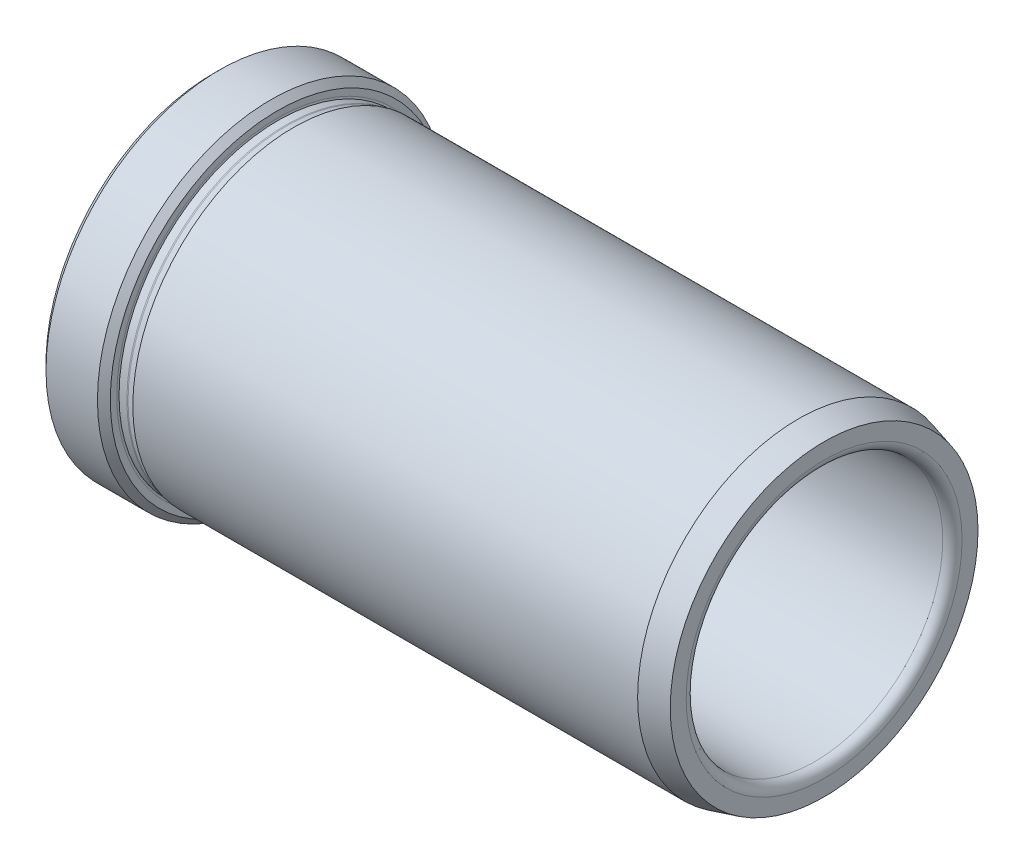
ISO-10303-21;
HEADER;
FILE_DESCRIPTION(('STEP AP214'),'2;1');
FILE_NAME('part.step','',(''),(''),'','','');
FILE_SCHEMA(('AUTOMOTIVE_DESIGN { 1 0 10303 214 1 1 1 1 }'));
ENDSEC;
DATA;
#1=APPLICATION_CONTEXT('core data for automotive mechanical design processes');
#2=APPLICATION_PROTOCOL_DEFINITION('international standard','automotive_design',2000,#1);
#3=PRODUCT_CONTEXT('',#1,'mechanical');
#4=PRODUCT('Part','Part','',(#3));
#5=PRODUCT_RELATED_PRODUCT_CATEGORY('part','',(#4));
#6=PRODUCT_DEFINITION_FORMATION('','',#4);
#7=PRODUCT_DEFINITION_CONTEXT('part definition',#1,'design');
#8=PRODUCT_DEFINITION('design','',#6,#7);
#9=PRODUCT_DEFINITION_SHAPE('','',#8);
#10=(LENGTH_UNIT() NAMED_UNIT(*) SI_UNIT(.MILLI.,.METRE.));
#11=(NAMED_UNIT(*) PLANE_ANGLE_UNIT() SI_UNIT($,.RADIAN.));
#12=(NAMED_UNIT(*) SI_UNIT($,.STERADIAN.) SOLID_ANGLE_UNIT());
#13=UNCERTAINTY_MEASURE_WITH_UNIT(LENGTH_MEASURE(1.E-05),#10,'distance_accuracy_value','');
#14=(GEOMETRIC_REPRESENTATION_CONTEXT(3) GLOBAL_UNCERTAINTY_ASSIGNED_CONTEXT((#13)) GLOBAL_UNIT_ASSIGNED_CONTEXT((#10,
#11,#12)) REPRESENTATION_CONTEXT('',''));
#15=CARTESIAN_POINT('',(0.,0.,0.));
#16=DIRECTION('',(0.,0.,1.));
#17=DIRECTION('',(1.,0.,0.));
#18=AXIS2_PLACEMENT_3D('',#15,#16,#17);
#19=CARTESIAN_POINT('',(30.9097582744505,19.95,0.));
#20=DIRECTION('',(1.,0.,0.));
#21=DIRECTION('',(0.,0.,-1.));
#22=AXIS2_PLACEMENT_3D('',#19,#20,#21);
#23=PLANE('',#22);
#24=CARTESIAN_POINT('',(30.9097582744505,0.,0.));
#25=DIRECTION('',(-1.,0.,0.));
#26=DIRECTION('',(0.,0.,1.));
#27=AXIS2_PLACEMENT_3D('',#24,#25,#26);
#28=CIRCLE('',#27,19.95);
#29=CARTESIAN_POINT('',(30.9097582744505,0.,19.95));
#30=VERTEX_POINT('',#29);
#31=EDGE_CURVE('E46',#30,#30,#28,.T.);
#32=ORIENTED_EDGE('',*,*,#31,.F.);
#33=EDGE_LOOP('',(#32));
#34=FACE_BOUND('',#33,.T.);
#35=CARTESIAN_POINT('',(30.9097582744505,0.,0.));
#36=DIRECTION('',(-1.,0.,0.));
#37=DIRECTION('',(0.,0.,1.));
#38=AXIS2_PLACEMENT_3D('',#35,#36,#37);
#39=CIRCLE('',#38,20.);
#40=CARTESIAN_POINT('',(30.9097582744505,0.,20.));
#41=VERTEX_POINT('',#40);
#42=EDGE_CURVE('E70',#41,#41,#39,.T.);
#43=ORIENTED_EDGE('',*,*,#42,.T.);
#44=EDGE_LOOP('',(#43));
#45=FACE_BOUND('',#44,.T.);
#46=ADVANCED_FACE('F14',(#34,#45),#23,.F.);
#47=CARTESIAN_POINT('',(0.,0.,0.));
#48=DIRECTION('',(-1.,0.,0.));
#49=DIRECTION('',(0.,0.,1.));
#50=AXIS2_PLACEMENT_3D('',#47,#48,#49);
#51=CYLINDRICAL_SURFACE('',#50,19.95);
#52=CARTESIAN_POINT('',(94.4097582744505,0.,0.));
#53=DIRECTION('',(-1.,0.,0.));
#54=DIRECTION('',(0.,0.,1.));
#55=AXIS2_PLACEMENT_3D('',#52,#53,#54);
#56=CIRCLE('',#55,19.95);
#57=CARTESIAN_POINT('',(94.4097582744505,0.,19.95));
#58=VERTEX_POINT('',#57);
#59=EDGE_CURVE('E34',#58,#58,#56,.F.);
#60=ORIENTED_EDGE('',*,*,#59,.T.);
#61=EDGE_LOOP('',(#60));
#62=FACE_BOUND('',#61,.T.);
#63=ORIENTED_EDGE('',*,*,#31,.T.);
#64=EDGE_LOOP('',(#63));
#65=FACE_BOUND('',#64,.T.);
#66=ADVANCED_FACE('F94',(#62,#65),#51,.F.);
#67=CARTESIAN_POINT('',(95.9097582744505,23.9282032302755,0.));
#68=DIRECTION('',(-1.,0.,0.));
#69=DIRECTION('',(0.,0.,1.));
#70=AXIS2_PLACEMENT_3D('',#67,#68,#69);
#71=PLANE('',#70);
#72=CARTESIAN_POINT('',(95.9097582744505,0.,0.));
#73=DIRECTION('',(-1.,0.,0.));
#74=DIRECTION('',(0.,0.,1.));
#75=AXIS2_PLACEMENT_3D('',#72,#73,#74);
#76=CIRCLE('',#75,21.45);
#77=CARTESIAN_POINT('',(95.9097582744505,0.,21.45));
#78=VERTEX_POINT('',#77);
#79=EDGE_CURVE('E37',#78,#78,#76,.T.);
#80=ORIENTED_EDGE('',*,*,#79,.T.);
#81=EDGE_LOOP('',(#80));
#82=FACE_BOUND('',#81,.T.);
#83=CARTESIAN_POINT('',(95.9097582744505,0.,0.));
#84=DIRECTION('',(-1.,0.,0.));
#85=DIRECTION('',(0.,0.,1.));
#86=AXIS2_PLACEMENT_3D('',#83,#84,#85);
#87=CIRCLE('',#86,23.9282032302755);
#88=CARTESIAN_POINT('',(95.9097582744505,0.,23.9282032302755));
#89=VERTEX_POINT('',#88);
#90=EDGE_CURVE('E49',#89,#89,#87,.T.);
#91=ORIENTED_EDGE('',*,*,#90,.F.);
#92=EDGE_LOOP('',(#91));
#93=FACE_BOUND('',#92,.T.);
#94=ADVANCED_FACE('F101',(#82,#93),#71,.F.);
#95=CARTESIAN_POINT('',(95.9097582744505,0.,0.));
#96=DIRECTION('',(-1.,0.,0.));
#97=DIRECTION('',(0.,0.,1.));
#98=AXIS2_PLACEMENT_3D('',#95,#96,#97);
#99=CONICAL_SURFACE('',#98,23.9282032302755,0.26179938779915);
#100=CARTESIAN_POINT('',(91.9097582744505,0.,0.));
#101=DIRECTION('',(-1.,0.,0.));
#102=DIRECTION('',(0.,0.,1.));
#103=AXIS2_PLACEMENT_3D('',#100,#101,#102);
#104=CIRCLE('',#103,25.);
#105=CARTESIAN_POINT('',(91.9097582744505,0.,25.));
#106=VERTEX_POINT('',#105);
#107=EDGE_CURVE('E52',#106,#106,#104,.T.);
#108=ORIENTED_EDGE('',*,*,#107,.F.);
#109=EDGE_LOOP('',(#108));
#110=FACE_BOUND('',#109,.T.);
#111=ORIENTED_EDGE('',*,*,#90,.T.);
#112=EDGE_LOOP('',(#111));
#113=FACE_BOUND('',#112,.T.);
#114=ADVANCED_FACE('F165',(#110,#113),#99,.T.);
#115=CARTESIAN_POINT('',(0.,0.,0.));
#116=DIRECTION('',(-1.,0.,0.));
#117=DIRECTION('',(0.,0.,1.));
#118=AXIS2_PLACEMENT_3D('',#115,#116,#117);
#119=CYLINDRICAL_SURFACE('',#118,25.);
#120=CARTESIAN_POINT('',(13.4097582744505,0.,0.));
#121=DIRECTION('',(-1.,0.,0.));
#122=DIRECTION('',(0.,0.,1.));
#123=AXIS2_PLACEMENT_3D('',#120,#121,#122);
#124=CIRCLE('',#123,25.);
#125=CARTESIAN_POINT('',(13.4097582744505,0.,25.));
#126=VERTEX_POINT('',#125);
#127=EDGE_CURVE('E55',#126,#126,#124,.T.);
#128=ORIENTED_EDGE('',*,*,#127,.F.);
#129=EDGE_LOOP('',(#128));
#130=FACE_BOUND('',#129,.T.);
#131=ORIENTED_EDGE('',*,*,#107,.T.);
#132=EDGE_LOOP('',(#131));
#133=FACE_BOUND('',#132,.T.);
#134=ADVANCED_FACE('F205',(#130,#133),#119,.T.);
#135=CARTESIAN_POINT('',(13.4097582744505,0.,0.));
#136=DIRECTION('',(1.,0.,0.));
#137=DIRECTION('',(0.,0.,-1.));
#138=AXIS2_PLACEMENT_3D('',#135,#136,#137);
#139=CONICAL_SURFACE('',#138,25.,0.261799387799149);
#140=CARTESIAN_POINT('',(12.3918762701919,0.,0.));
#141=DIRECTION('',(-1.,0.,0.));
#142=DIRECTION('',(0.,0.,1.));
#143=AXIS2_PLACEMENT_3D('',#140,#141,#142);
#144=CIRCLE('',#143,24.7272593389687);
#145=CARTESIAN_POINT('',(12.3918762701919,0.,24.7272593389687));
#146=VERTEX_POINT('',#145);
#147=EDGE_CURVE('E58',#146,#146,#144,.T.);
#148=ORIENTED_EDGE('',*,*,#147,.F.);
#149=EDGE_LOOP('',(#148));
#150=FACE_BOUND('',#149,.T.);
#151=ORIENTED_EDGE('',*,*,#127,.T.);
#152=EDGE_LOOP('',(#151));
#153=FACE_BOUND('',#152,.T.);
#154=ADVANCED_FACE('F195',(#150,#153),#139,.T.);
#155=CARTESIAN_POINT('',(12.1848210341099,0.,0.));
#156=DIRECTION('',(-1.,0.,0.));
#157=DIRECTION('',(0.,0.,1.));
#158=AXIS2_PLACEMENT_3D('',#155,#156,#157);
#159=TOROIDAL_SURFACE('',#158,25.5,0.8);
#160=CARTESIAN_POINT('',(12.1848210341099,0.,0.));
#161=DIRECTION('',(-1.,0.,0.));
#162=DIRECTION('',(0.,0.,1.));
#163=AXIS2_PLACEMENT_3D('',#160,#161,#162);
#164=CIRCLE('',#163,24.7);
#165=CARTESIAN_POINT('',(12.1848210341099,0.,24.7));
#166=VERTEX_POINT('',#165);
#167=EDGE_CURVE('E61',#166,#166,#164,.T.);
#168=ORIENTED_EDGE('',*,*,#167,.F.);
#169=EDGE_LOOP('',(#168));
#170=FACE_BOUND('',#169,.T.);
#171=ORIENTED_EDGE('',*,*,#147,.T.);
#172=EDGE_LOOP('',(#171));
#173=FACE_BOUND('',#172,.T.);
#174=ADVANCED_FACE('F185',(#170,#173),#159,.F.);
#175=CARTESIAN_POINT('',(0.,0.,0.));
#176=DIRECTION('',(-1.,0.,0.));
#177=DIRECTION('',(0.,0.,1.));
#178=AXIS2_PLACEMENT_3D('',#175,#176,#177);
#179=CYLINDRICAL_SURFACE('',#178,24.7);
#180=CARTESIAN_POINT('',(10.9669769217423,0.,0.));
#181=DIRECTION('',(-1.,0.,0.));
#182=DIRECTION('',(0.,0.,1.));
#183=AXIS2_PLACEMENT_3D('',#180,#181,#182);
#184=CIRCLE('',#183,24.7);
#185=CARTESIAN_POINT('',(10.9669769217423,0.,24.7));
#186=VERTEX_POINT('',#185);
#187=EDGE_CURVE('E64',#186,#186,#184,.T.);
#188=ORIENTED_EDGE('',*,*,#187,.F.);
#189=EDGE_LOOP('',(#188));
#190=FACE_BOUND('',#189,.T.);
#191=ORIENTED_EDGE('',*,*,#167,.T.);
#192=EDGE_LOOP('',(#191));
#193=FACE_BOUND('',#192,.T.);
#194=ADVANCED_FACE('F175',(#190,#193),#179,.T.);
#195=CARTESIAN_POINT('',(11.7097582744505,0.,0.));
#196=DIRECTION('',(-1.,0.,0.));
#197=DIRECTION('',(0.,0.,1.));
#198=AXIS2_PLACEMENT_3D('',#195,#196,#197);
#199=TOROIDAL_SURFACE('',#198,24.9971125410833,0.8);
#200=CARTESIAN_POINT('',(10.9097582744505,0.,0.));
#201=DIRECTION('',(-1.,0.,0.));
#202=DIRECTION('',(0.,0.,1.));
#203=AXIS2_PLACEMENT_3D('',#200,#201,#202);
#204=CIRCLE('',#203,24.9971125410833);
#205=CARTESIAN_POINT('',(10.9097582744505,0.,24.9971125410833));
#206=VERTEX_POINT('',#205);
#207=EDGE_CURVE('E67',#206,#206,#204,.T.);
#208=ORIENTED_EDGE('',*,*,#207,.F.);
#209=EDGE_LOOP('',(#208));
#210=FACE_BOUND('',#209,.T.);
#211=ORIENTED_EDGE('',*,*,#187,.T.);
#212=EDGE_LOOP('',(#211));
#213=FACE_BOUND('',#212,.T.);
#214=ADVANCED_FACE('F154',(#210,#213),#199,.F.);
#215=CARTESIAN_POINT('',(10.9097582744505,27.,0.));
#216=DIRECTION('',(-1.,0.,0.));
#217=DIRECTION('',(0.,0.,1.));
#218=AXIS2_PLACEMENT_3D('',#215,#216,#217);
#219=PLANE('',#218);
#220=CARTESIAN_POINT('',(10.9097582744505,0.,0.));
#221=DIRECTION('',(-1.,0.,0.));
#222=DIRECTION('',(0.,0.,1.));
#223=AXIS2_PLACEMENT_3D('',#220,#221,#222);
#224=CIRCLE('',#223,26.);
#225=CARTESIAN_POINT('',(10.9097582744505,0.,26.));
#226=VERTEX_POINT('',#225);
#227=EDGE_CURVE('E9',#226,#226,#224,.F.);
#228=ORIENTED_EDGE('',*,*,#227,.T.);
#229=EDGE_LOOP('',(#228));
#230=FACE_BOUND('',#229,.T.);
#231=ORIENTED_EDGE('',*,*,#207,.T.);
#232=EDGE_LOOP('',(#231));
#233=FACE_BOUND('',#232,.T.);
#234=ADVANCED_FACE('F144',(#230,#233),#219,.F.);
#235=CARTESIAN_POINT('',(0.,0.,0.));
#236=DIRECTION('',(-1.,0.,0.));
#237=DIRECTION('',(0.,0.,1.));
#238=AXIS2_PLACEMENT_3D('',#235,#236,#237);
#239=CYLINDRICAL_SURFACE('',#238,27.);
#240=CARTESIAN_POINT('',(9.90975827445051,0.,0.));
#241=DIRECTION('',(-1.,0.,0.));
#242=DIRECTION('',(0.,0.,1.));
#243=AXIS2_PLACEMENT_3D('',#240,#241,#242);
#244=CIRCLE('',#243,27.);
#245=CARTESIAN_POINT('',(9.90975827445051,0.,27.));
#246=VERTEX_POINT('',#245);
#247=EDGE_CURVE('E21',#246,#246,#244,.T.);
#248=ORIENTED_EDGE('',*,*,#247,.T.);
#249=EDGE_LOOP('',(#248));
#250=FACE_BOUND('',#249,.T.);
#251=CARTESIAN_POINT('',(1.9097582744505,0.,0.));
#252=DIRECTION('',(1.,0.,0.));
#253=DIRECTION('',(0.,0.,-1.));
#254=AXIS2_PLACEMENT_3D('',#251,#252,#253);
#255=CIRCLE('',#254,27.);
#256=CARTESIAN_POINT('',(1.9097582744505,0.,-27.));
#257=VERTEX_POINT('',#256);
#258=EDGE_CURVE('E40',#257,#257,#255,.T.);
#259=ORIENTED_EDGE('',*,*,#258,.T.);
#260=EDGE_LOOP('',(#259));
#261=FACE_BOUND('',#260,.T.);
#262=ADVANCED_FACE('F90',(#250,#261),#239,.T.);
#263=CARTESIAN_POINT('',(0.909758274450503,27.,0.));
#264=DIRECTION('',(1.,0.,0.));
#265=DIRECTION('',(0.,0.,-1.));
#266=AXIS2_PLACEMENT_3D('',#263,#264,#265);
#267=PLANE('',#266);
#268=CARTESIAN_POINT('',(0.909758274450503,0.,0.));
#269=DIRECTION('',(1.,0.,0.));
#270=DIRECTION('',(0.,0.,-1.));
#271=AXIS2_PLACEMENT_3D('',#268,#269,#270);
#272=CIRCLE('',#271,21.5);
#273=CARTESIAN_POINT('',(0.909758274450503,0.,-21.5));
#274=VERTEX_POINT('',#273);
#275=EDGE_CURVE('E25',#274,#274,#272,.T.);
#276=ORIENTED_EDGE('',*,*,#275,.T.);
#277=EDGE_LOOP('',(#276));
#278=FACE_BOUND('',#277,.T.);
#279=CARTESIAN_POINT('',(0.909758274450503,0.,0.));
#280=DIRECTION('',(1.,0.,0.));
#281=DIRECTION('',(0.,0.,-1.));
#282=AXIS2_PLACEMENT_3D('',#279,#280,#281);
#283=CIRCLE('',#282,26.);
#284=CARTESIAN_POINT('',(0.909758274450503,0.,-26.));
#285=VERTEX_POINT('',#284);
#286=EDGE_CURVE('E43',#285,#285,#283,.F.);
#287=ORIENTED_EDGE('',*,*,#286,.T.);
#288=EDGE_LOOP('',(#287));
#289=FACE_BOUND('',#288,.T.);
#290=ADVANCED_FACE('F78',(#278,#289),#267,.F.);
#291=CARTESIAN_POINT('',(0.,0.,0.));
#292=DIRECTION('',(-1.,0.,0.));
#293=DIRECTION('',(0.,0.,1.));
#294=AXIS2_PLACEMENT_3D('',#291,#292,#293);
#295=CYLINDRICAL_SURFACE('',#294,20.);
#296=CARTESIAN_POINT('',(2.40975827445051,0.,0.));
#297=DIRECTION('',(1.,0.,0.));
#298=DIRECTION('',(0.,0.,-1.));
#299=AXIS2_PLACEMENT_3D('',#296,#297,#298);
#300=CIRCLE('',#299,20.);
#301=CARTESIAN_POINT('',(2.40975827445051,0.,-20.));
#302=VERTEX_POINT('',#301);
#303=EDGE_CURVE('E29',#302,#302,#300,.F.);
#304=ORIENTED_EDGE('',*,*,#303,.T.);
#305=EDGE_LOOP('',(#304));
#306=FACE_BOUND('',#305,.T.);
#307=ORIENTED_EDGE('',*,*,#42,.F.);
#308=EDGE_LOOP('',(#307));
#309=FACE_BOUND('',#308,.T.);
#310=ADVANCED_FACE('F75',(#306,#309),#295,.F.);
#311=CARTESIAN_POINT('',(0.909758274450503,0.,0.));
#312=DIRECTION('',(1.,0.,0.));
#313=DIRECTION('',(0.,0.,-1.));
#314=AXIS2_PLACEMENT_3D('',#311,#312,#313);
#315=CONICAL_SURFACE('',#314,26.,0.78539816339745);
#316=ORIENTED_EDGE('',*,*,#258,.F.);
#317=EDGE_LOOP('',(#316));
#318=FACE_BOUND('',#317,.T.);
#319=ORIENTED_EDGE('',*,*,#286,.F.);
#320=EDGE_LOOP('',(#319));
#321=FACE_BOUND('',#320,.T.);
#322=ADVANCED_FACE('F77',(#318,#321),#315,.T.);
#323=CARTESIAN_POINT('',(94.4097582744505,0.,0.));
#324=DIRECTION('',(-1.,0.,0.));
#325=DIRECTION('',(0.,0.,1.));
#326=AXIS2_PLACEMENT_3D('',#323,#324,#325);
#327=TOROIDAL_SURFACE('',#326,21.45,1.5);
#328=ORIENTED_EDGE('',*,*,#59,.F.);
#329=EDGE_LOOP('',(#328));
#330=FACE_BOUND('',#329,.T.);
#331=ORIENTED_EDGE('',*,*,#79,.F.);
#332=EDGE_LOOP('',(#331));
#333=FACE_BOUND('',#332,.T.);
#334=ADVANCED_FACE('F87',(#330,#333),#327,.T.);
#335=CARTESIAN_POINT('',(2.40975827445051,0.,0.));
#336=DIRECTION('',(1.,0.,0.));
#337=DIRECTION('',(0.,0.,-1.));
#338=AXIS2_PLACEMENT_3D('',#335,#336,#337);
#339=TOROIDAL_SURFACE('',#338,21.5,1.5);
#340=ORIENTED_EDGE('',*,*,#275,.F.);
#341=EDGE_LOOP('',(#340));
#342=FACE_BOUND('',#341,.T.);
#343=ORIENTED_EDGE('',*,*,#303,.F.);
#344=EDGE_LOOP('',(#343));
#345=FACE_BOUND('',#344,.T.);
#346=ADVANCED_FACE('F108',(#342,#345),#339,.T.);
#347=CARTESIAN_POINT('',(9.90975827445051,0.,0.));
#348=DIRECTION('',(-1.,0.,0.));
#349=DIRECTION('',(0.,0.,1.));
#350=AXIS2_PLACEMENT_3D('',#347,#348,#349);
#351=CONICAL_SURFACE('',#350,27.,0.785398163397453);
#352=ORIENTED_EDGE('',*,*,#227,.F.);
#353=EDGE_LOOP('',(#352));
#354=FACE_BOUND('',#353,.T.);
#355=ORIENTED_EDGE('',*,*,#247,.F.);
#356=EDGE_LOOP('',(#355));
#357=FACE_BOUND('',#356,.T.);
#358=ADVANCED_FACE('F16',(#354,#357),#351,.T.);
#359=CLOSED_SHELL('',(#46,#66,#94,#114,#134,#154,#174,#194,#214,#234,#262,#290,#310,#322,#334,
#346,#358));
#360=MANIFOLD_SOLID_BREP('B1',#359);
#361=ADVANCED_BREP_SHAPE_REPRESENTATION('',(#18,#360),#14);
#362=SHAPE_DEFINITION_REPRESENTATION(#9,#361);
ENDSEC;
END-ISO-10303-21;
